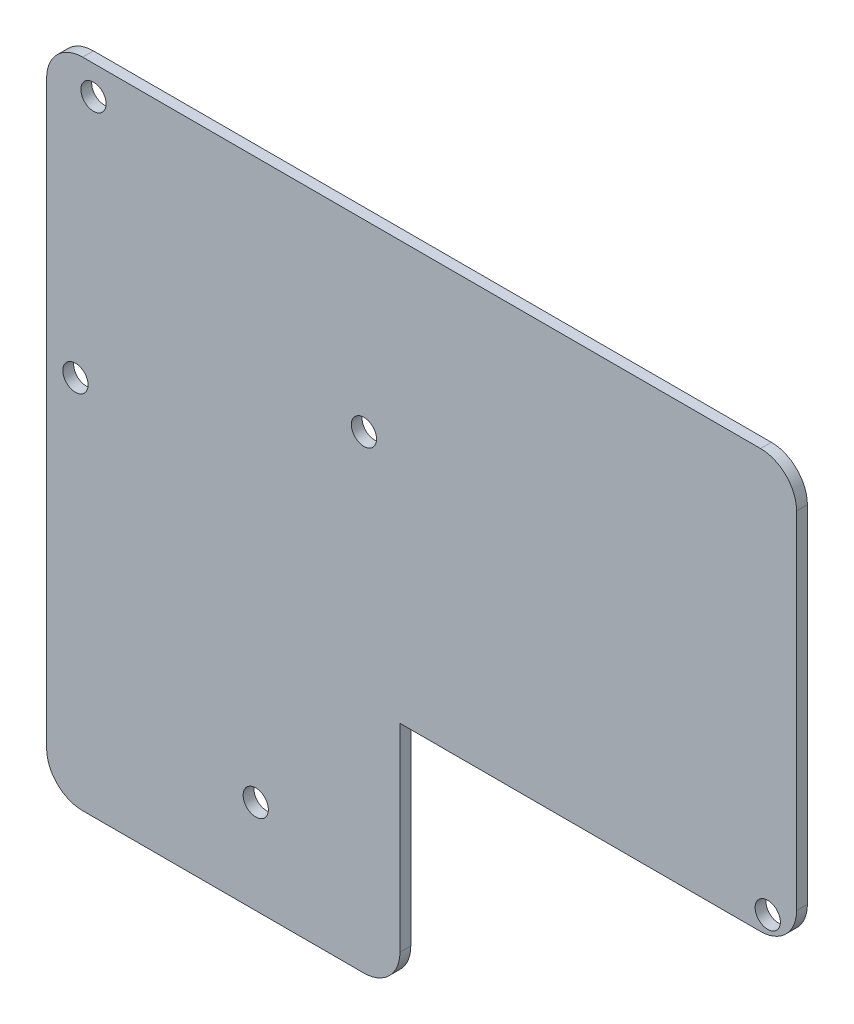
from build123d import *

# Parameters (mm, degrees)
SKETCH_1_R          = 3.5
EXTRUDE_1_DEPTH     = 3
SKETCH_2_R          = 3.5
CUT_EXTRUDE_1_DEPTH = 268.389229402
FILLET_1_R          = 10
FILLET_2_R          = 10
FILLET_3_R          = 10


with BuildPart() as part:
    # Sketch 1 → Extrude 1 (new body)
    # profile 1 of 2: a face of its own
    with BuildSketch(Plane.XY):
        Polygon((0, 13), (0, 0), (8, 0), (85, 0), (88, 0), (195, 0), (195, -61.792031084), (195, -90), (85, -90), (85, -155), (58, -155), (0, -155), (0, -168), (98, -168), (98, -103), (200, -103), (208, -103), (208, -98), (208, 0), (208, 13), (195, 13), align=None)
        with Locations((200, -98)):
            Circle(SKETCH_1_R, mode=Mode.SUBTRACT)
    # profile 2 of 2: a face of its own
    with BuildSketch(Plane.XY):
        Polygon((8, 0), (0, 0), (0, -38), (0, -65), (0, -142), (0, -155), (58, -155), (85, -155), (85, -90), (195, -90), (195, -61.792031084), (195, 0), (88, 0), (85, 0), align=None)
        with Locations((58, -142)):
            Circle(SKETCH_1_R, mode=Mode.SUBTRACT)
        with Locations((8, -65)):
            Circle(SKETCH_1_R, mode=Mode.SUBTRACT)
        with BuildLine():
            ThreePointArc((91.5, -38), (88, -41.5), (84.5, -38))
            ThreePointArc((84.5, -38), (88, -34.5), (91.5, -38))
        make_face(mode=Mode.SUBTRACT)
    extrude(amount=EXTRUDE_1_DEPTH)

    # Sketch 2 → Cut-Extrude 1 (cut, through all)
    with BuildSketch(Plane.XY.offset(3)):
        with Locations((13, 5)):
            Circle(SKETCH_2_R)
    extrude(amount=-CUT_EXTRUDE_1_DEPTH, mode=Mode.SUBTRACT)

    # Fillet 1
    fillet_1_edges = [part.edges().sort_by_distance(p)[0] for p in [
        (208, 13, 1.5),
    ]]
    fillet(fillet_1_edges, radius=FILLET_1_R)

    # Fillet 2
    fillet_2_edges = [part.edges().sort_by_distance(p)[0] for p in [
        (0, 13, 1.5),
    ]]
    fillet(fillet_2_edges, radius=FILLET_2_R)

    # Fillet 3
    fillet_3_edges = [part.edges().sort_by_distance(p)[0] for p in [
        (208, -103, 1.5),
        (98, -168, 1.5),
        (0, -168, 1.5),
    ]]
    fillet(fillet_3_edges, radius=FILLET_3_R)


solid = part.part
